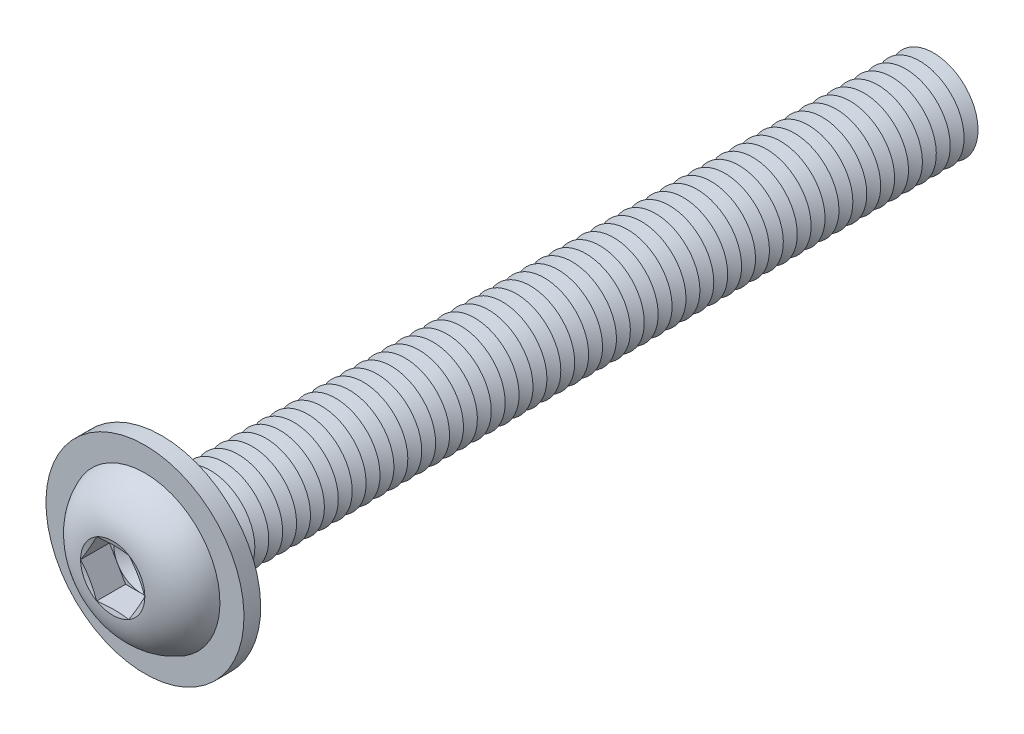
from build123d import *

# Parameters (mm, degrees)
FILLET1_R           = 0.625
LPATTERN1_COUNT     = 56
LPATTERN1_PITCH     = 1.25
CUT_EXTRUDE1_DEPTH  = 2.6
SKETCH5_R           = 8.9
SKETCH5_R_2         = 4.625
BOSS_EXTRUDE1_DEPTH = 1.5


with BuildPart() as part:
    # Sketch1 → Revolve1 (revolve)
    with BuildSketch(Plane(origin=(0, 0, 0), x_dir=(0, 0, -1), z_dir=(1, 0, 0))):
        with BuildLine():
            Line((0, 4), (0, 7))
            ThreePointArc((0, 7), (-3.011595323, 5.81154966), (-4.4, 2.88675))
            Line((-4.4, 2.88675), (-4.013248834, 1.443375))
            Line((-4.013248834, 1.443375), (-4.4, 1.443375))
            Line((-4.4, 1.443375), (-4.4, 0))
            Line((-4.4, 0), (70, 0))
            Line((70, 0), (70, 4))
            Line((70, 4), (0, 4))
        make_face()
    revolve(axis=Axis((0, 0, -70), (0, 0, 1)))

    # Fillet1
    fillet1_edges = [part.edges().sort_by_distance(p)[0] for p in [
        (0, -4, 0),
    ]]
    fillet(fillet1_edges, radius=FILLET1_R)

    # Sketch2 → Cut-Revolve1 (revolve, cut)
    with BuildSketch(Plane(origin=(0, 0, 0), x_dir=(0, 0, -1), z_dir=(1, 0, 0))):
        Polygon((69.375, 4), (70.625, 4), (70, 2.917468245), align=None)
    cut_revolve1 = revolve(axis=Axis((0, 0, -70), (0, 0, -1)), mode=Mode.SUBTRACT)

    # LPattern1: Cut-Revolve1 ×56
    with Locations(*[(0, 0, i * LPATTERN1_PITCH) for i in range(1, LPATTERN1_COUNT)]):
        add(cut_revolve1, mode=Mode.SUBTRACT)

    # Sketch3 → Cut-Extrude1 (cut)
    with BuildSketch(Plane.XY.offset(4.4)):
        Polygon((1.443375, 2.499998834), (-1.443375, 2.499998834), (-2.88675, 0), (-1.443375, -2.499998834), (1.443375, -2.499998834), (2.88675, 0), align=None)
    extrude(amount=-CUT_EXTRUDE1_DEPTH, mode=Mode.SUBTRACT)

    # Cut-Extrude2 cone 1 section (on through the dimple's axis) → Cut-Extrude2 (revolve, cut)
    with BuildSketch(Plane(origin=(0, 0, 1.8), x_dir=(0, -1, 0), z_dir=(1, 0, 0))):
        Polygon((0, 0), (2.499998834, 0), (0, 1.443375), align=None)
    revolve(axis=Axis((0, 0, 1.8), (0, 0, -1)), mode=Mode.SUBTRACT)

    # Sketch5 → Boss-Extrude1 (add)
    with BuildSketch(Plane(origin=(0, 0, 0), x_dir=(-1, 0, 0), z_dir=(0, 0, -1))):
        with Locations(Location((0, 0, 0), (0, 0, 90))):
            Circle(SKETCH5_R)
        Circle(SKETCH5_R_2, mode=Mode.SUBTRACT)
    extrude(amount=-BOSS_EXTRUDE1_DEPTH)


solid = part.part
